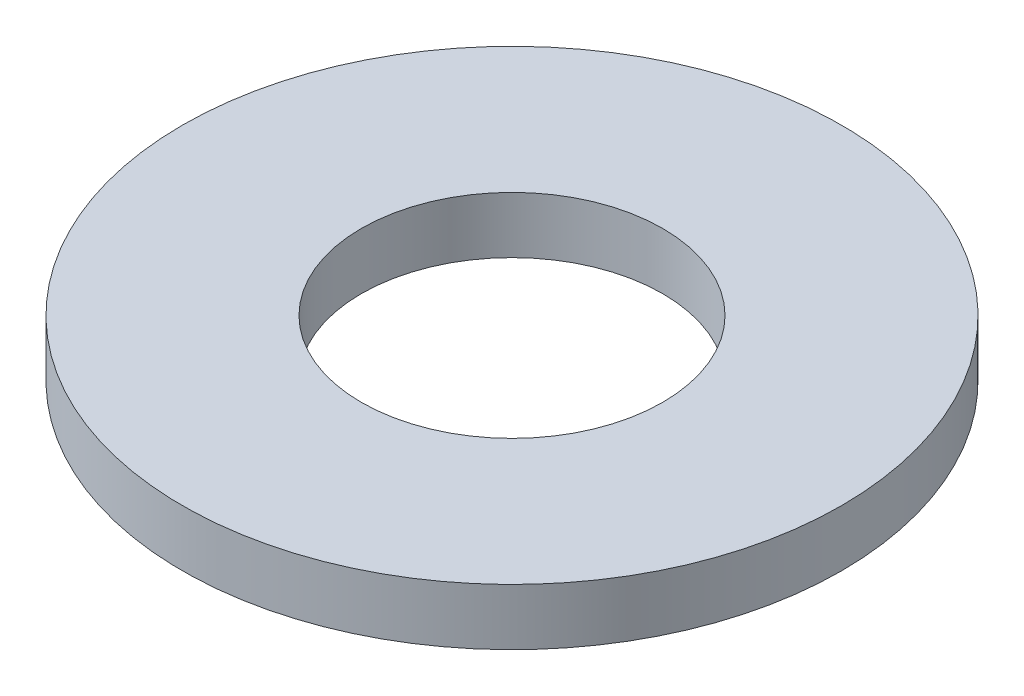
ISO-10303-21;
HEADER;
FILE_DESCRIPTION(('STEP AP214'),'2;1');
FILE_NAME('part.step','',(''),(''),'','','');
FILE_SCHEMA(('AUTOMOTIVE_DESIGN { 1 0 10303 214 1 1 1 1 }'));
ENDSEC;
DATA;
#1=APPLICATION_CONTEXT('core data for automotive mechanical design processes');
#2=APPLICATION_PROTOCOL_DEFINITION('international standard','automotive_design',2000,#1);
#3=PRODUCT_CONTEXT('',#1,'mechanical');
#4=PRODUCT('Part','Part','',(#3));
#5=PRODUCT_RELATED_PRODUCT_CATEGORY('part','',(#4));
#6=PRODUCT_DEFINITION_FORMATION('','',#4);
#7=PRODUCT_DEFINITION_CONTEXT('part definition',#1,'design');
#8=PRODUCT_DEFINITION('design','',#6,#7);
#9=PRODUCT_DEFINITION_SHAPE('','',#8);
#10=(LENGTH_UNIT() NAMED_UNIT(*) SI_UNIT(.MILLI.,.METRE.));
#11=(NAMED_UNIT(*) PLANE_ANGLE_UNIT() SI_UNIT($,.RADIAN.));
#12=(NAMED_UNIT(*) SI_UNIT($,.STERADIAN.) SOLID_ANGLE_UNIT());
#13=UNCERTAINTY_MEASURE_WITH_UNIT(LENGTH_MEASURE(1.E-05),#10,'distance_accuracy_value','');
#14=(GEOMETRIC_REPRESENTATION_CONTEXT(3) GLOBAL_UNCERTAINTY_ASSIGNED_CONTEXT((#13)) GLOBAL_UNIT_ASSIGNED_CONTEXT((#10,
#11,#12)) REPRESENTATION_CONTEXT('',''));
#15=CARTESIAN_POINT('',(0.,0.,0.));
#16=DIRECTION('',(0.,0.,1.));
#17=DIRECTION('',(1.,0.,0.));
#18=AXIS2_PLACEMENT_3D('',#15,#16,#17);
#19=CARTESIAN_POINT('',(0.,1.2,0.));
#20=DIRECTION('',(0.,1.,0.));
#21=DIRECTION('',(0.,0.,1.));
#22=AXIS2_PLACEMENT_3D('',#19,#20,#21);
#23=PLANE('',#22);
#24=CARTESIAN_POINT('',(0.,1.2,0.));
#25=DIRECTION('',(0.,-1.,0.));
#26=DIRECTION('',(1.,0.,0.));
#27=AXIS2_PLACEMENT_3D('',#24,#25,#26);
#28=CIRCLE('',#27,3.2);
#29=CARTESIAN_POINT('',(3.2,1.2,0.));
#30=VERTEX_POINT('',#29);
#31=EDGE_CURVE('E25',#30,#30,#28,.T.);
#32=ORIENTED_EDGE('',*,*,#31,.T.);
#33=EDGE_LOOP('',(#32));
#34=FACE_BOUND('',#33,.T.);
#35=CARTESIAN_POINT('',(0.,1.2,0.));
#36=DIRECTION('',(0.,-1.,0.));
#37=DIRECTION('',(1.,0.,0.));
#38=AXIS2_PLACEMENT_3D('',#35,#36,#37);
#39=CIRCLE('',#38,7.);
#40=CARTESIAN_POINT('',(7.,1.2,0.));
#41=VERTEX_POINT('',#40);
#42=EDGE_CURVE('E9',#41,#41,#39,.T.);
#43=ORIENTED_EDGE('',*,*,#42,.F.);
#44=EDGE_LOOP('',(#43));
#45=FACE_BOUND('',#44,.T.);
#46=ADVANCED_FACE('F14',(#34,#45),#23,.T.);
#47=CARTESIAN_POINT('',(0.,0.,0.));
#48=DIRECTION('',(0.,-1.,0.));
#49=DIRECTION('',(0.,0.,-1.));
#50=AXIS2_PLACEMENT_3D('',#47,#48,#49);
#51=PLANE('',#50);
#52=CARTESIAN_POINT('',(0.,0.,0.));
#53=DIRECTION('',(0.,1.,0.));
#54=DIRECTION('',(1.,0.,0.));
#55=AXIS2_PLACEMENT_3D('',#52,#53,#54);
#56=CIRCLE('',#55,3.2);
#57=CARTESIAN_POINT('',(3.2,0.,0.));
#58=VERTEX_POINT('',#57);
#59=EDGE_CURVE('E29',#58,#58,#56,.T.);
#60=ORIENTED_EDGE('',*,*,#59,.T.);
#61=EDGE_LOOP('',(#60));
#62=FACE_BOUND('',#61,.T.);
#63=CARTESIAN_POINT('',(0.,0.,0.));
#64=DIRECTION('',(0.,1.,0.));
#65=DIRECTION('',(1.,0.,0.));
#66=AXIS2_PLACEMENT_3D('',#63,#64,#65);
#67=CIRCLE('',#66,7.);
#68=CARTESIAN_POINT('',(7.,0.,0.));
#69=VERTEX_POINT('',#68);
#70=EDGE_CURVE('E21',#69,#69,#67,.T.);
#71=ORIENTED_EDGE('',*,*,#70,.F.);
#72=EDGE_LOOP('',(#71));
#73=FACE_BOUND('',#72,.T.);
#74=ADVANCED_FACE('F35',(#62,#73),#51,.T.);
#75=CARTESIAN_POINT('',(0.,0.,0.));
#76=DIRECTION('',(0.,1.,0.));
#77=DIRECTION('',(1.,0.,0.));
#78=AXIS2_PLACEMENT_3D('',#75,#76,#77);
#79=CYLINDRICAL_SURFACE('',#78,7.);
#80=ORIENTED_EDGE('',*,*,#42,.T.);
#81=EDGE_LOOP('',(#80));
#82=FACE_BOUND('',#81,.T.);
#83=ORIENTED_EDGE('',*,*,#70,.T.);
#84=EDGE_LOOP('',(#83));
#85=FACE_BOUND('',#84,.T.);
#86=ADVANCED_FACE('F16',(#82,#85),#79,.T.);
#87=CARTESIAN_POINT('',(0.,0.,0.));
#88=DIRECTION('',(0.,1.,0.));
#89=DIRECTION('',(1.,0.,0.));
#90=AXIS2_PLACEMENT_3D('',#87,#88,#89);
#91=CYLINDRICAL_SURFACE('',#90,3.2);
#92=ORIENTED_EDGE('',*,*,#31,.F.);
#93=EDGE_LOOP('',(#92));
#94=FACE_BOUND('',#93,.T.);
#95=ORIENTED_EDGE('',*,*,#59,.F.);
#96=EDGE_LOOP('',(#95));
#97=FACE_BOUND('',#96,.T.);
#98=ADVANCED_FACE('F38',(#94,#97),#91,.F.);
#99=CLOSED_SHELL('',(#46,#74,#86,#98));
#100=MANIFOLD_SOLID_BREP('B1',#99);
#101=ADVANCED_BREP_SHAPE_REPRESENTATION('',(#18,#100),#14);
#102=SHAPE_DEFINITION_REPRESENTATION(#9,#101);
ENDSEC;
END-ISO-10303-21;
